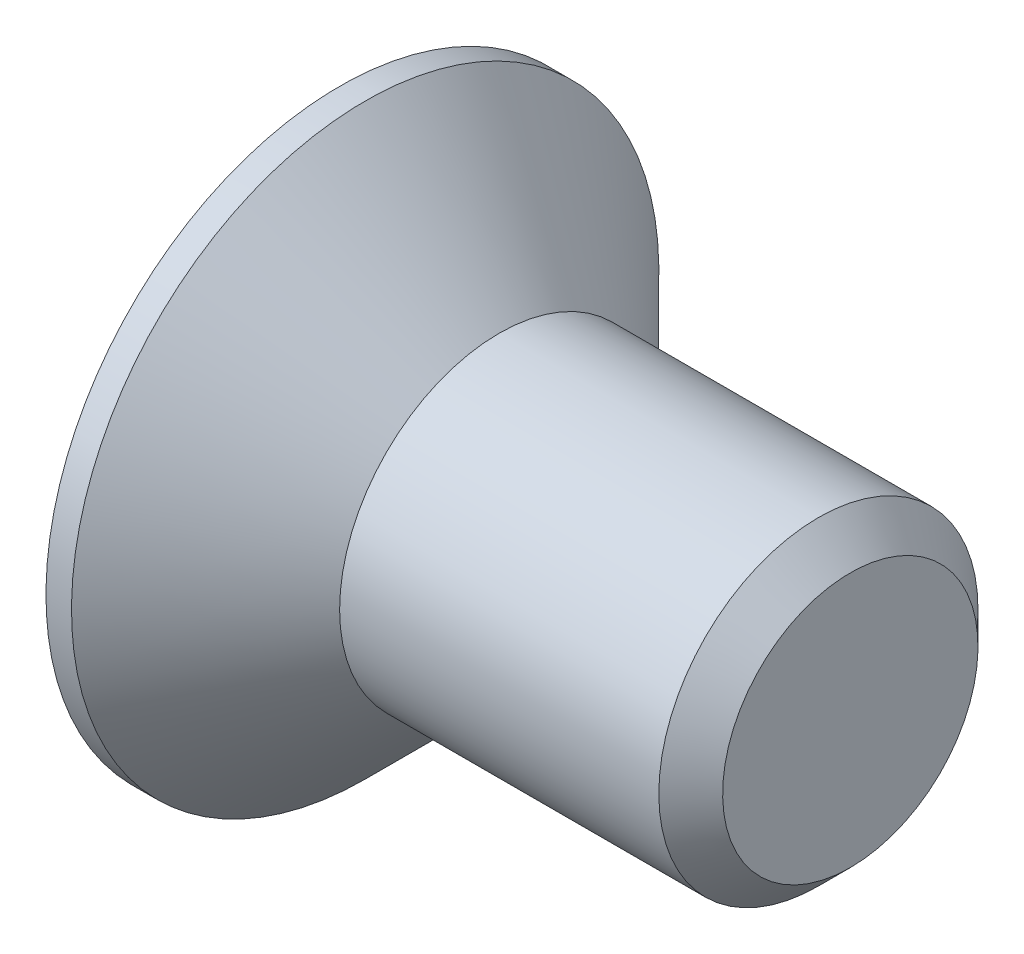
from build123d import *

# Parameters (mm, degrees)
CHAMFER1_SIZE      = 0.5
CUT_EXTRUDE1_DEPTH = 2.1


with BuildPart() as part:
    # Sketch1 → Revolve1 (revolve)
    with BuildSketch(Plane.XY, mode=Mode.PRIVATE) as revolve1_sk:
        Polygon((-2.5, 4.6), (-2.5, 0), (5.5, 0), (5.5, 2.5), (0, 2.5), (-2.1, 4.6), align=None)
    revolve(revolve1_sk.sketch.rotate(Axis((-2.5, 0, 0), (1, 0, 0)), 180), axis=Axis((-2.5, 0, 0), (1, 0, 0)))

    # Chamfer1
    chamfer1_edges = [part.edges().sort_by_distance(p)[0] for p in [
        (5.5, 2.5, 0),
    ]]
    chamfer(chamfer1_edges, length=CHAMFER1_SIZE)

    # Sketch2 → Cut-Extrude1 (cut)
    with BuildSketch(Plane.ZY.offset(2.5)):
        Polygon((-0.575, 2.3), (0.575, 2.3), (0.575, 0.575), (2.3, 0.575), (2.3, -0.575), (0.575, -0.575), (0.575, -2.3), (-0.575, -2.3), (-0.575, -0.575), (-2.3, -0.575), (-2.3, 0.575), (-0.575, 0.575), align=None)
    extrude(amount=-CUT_EXTRUDE1_DEPTH, mode=Mode.SUBTRACT)


solid = part.part
